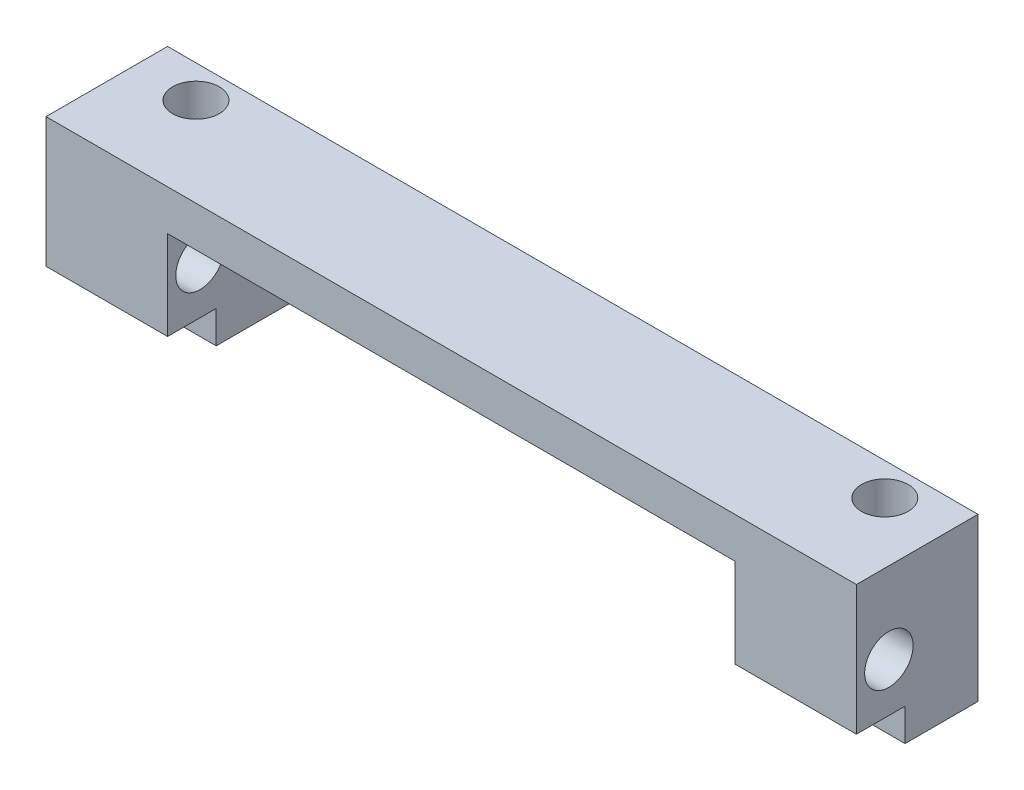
ISO-10303-21;
HEADER;
FILE_DESCRIPTION(('STEP AP214'),'2;1');
FILE_NAME('part.step','',(''),(''),'','','');
FILE_SCHEMA(('AUTOMOTIVE_DESIGN { 1 0 10303 214 1 1 1 1 }'));
ENDSEC;
DATA;
#1=APPLICATION_CONTEXT('core data for automotive mechanical design processes');
#2=APPLICATION_PROTOCOL_DEFINITION('international standard','automotive_design',2000,#1);
#3=PRODUCT_CONTEXT('',#1,'mechanical');
#4=PRODUCT('Part','Part','',(#3));
#5=PRODUCT_RELATED_PRODUCT_CATEGORY('part','',(#4));
#6=PRODUCT_DEFINITION_FORMATION('','',#4);
#7=PRODUCT_DEFINITION_CONTEXT('part definition',#1,'design');
#8=PRODUCT_DEFINITION('design','',#6,#7);
#9=PRODUCT_DEFINITION_SHAPE('','',#8);
#10=(LENGTH_UNIT() NAMED_UNIT(*) SI_UNIT(.MILLI.,.METRE.));
#11=(NAMED_UNIT(*) PLANE_ANGLE_UNIT() SI_UNIT($,.RADIAN.));
#12=(NAMED_UNIT(*) SI_UNIT($,.STERADIAN.) SOLID_ANGLE_UNIT());
#13=UNCERTAINTY_MEASURE_WITH_UNIT(LENGTH_MEASURE(1.E-05),#10,'distance_accuracy_value','');
#14=(GEOMETRIC_REPRESENTATION_CONTEXT(3) GLOBAL_UNCERTAINTY_ASSIGNED_CONTEXT((#13)) GLOBAL_UNIT_ASSIGNED_CONTEXT((#10,
#11,#12)) REPRESENTATION_CONTEXT('',''));
#15=CARTESIAN_POINT('',(0.,0.,0.));
#16=DIRECTION('',(0.,0.,1.));
#17=DIRECTION('',(1.,0.,0.));
#18=AXIS2_PLACEMENT_3D('',#15,#16,#17);
#19=CARTESIAN_POINT('',(-31.75,0.,0.));
#20=DIRECTION('',(0.,1.,0.));
#21=DIRECTION('',(0.,0.,1.));
#22=AXIS2_PLACEMENT_3D('',#19,#20,#21);
#23=PLANE('',#22);
#24=CARTESIAN_POINT('',(-26.9875,0.,-6.985));
#25=DIRECTION('',(0.,1.,0.));
#26=DIRECTION('',(0.,0.,1.));
#27=AXIS2_PLACEMENT_3D('',#24,#25,#26);
#28=CIRCLE('',#27,1.8288);
#29=CARTESIAN_POINT('',(-26.9875,0.,-5.1562));
#30=VERTEX_POINT('',#29);
#31=EDGE_CURVE('E200',#30,#30,#28,.T.);
#32=ORIENTED_EDGE('',*,*,#31,.T.);
#33=EDGE_LOOP('',(#32));
#34=FACE_BOUND('',#33,.T.);
#35=DIRECTION('',(0.,0.,1.));
#36=VECTOR('',#35,1.);
#37=CARTESIAN_POINT('',(-22.225,0.,-9.525));
#38=LINE('',#37,#36);
#39=CARTESIAN_POINT('',(-22.225,0.,-9.525));
#40=VERTEX_POINT('',#39);
#41=CARTESIAN_POINT('',(-22.225,0.,-3.81000000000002));
#42=VERTEX_POINT('',#41);
#43=EDGE_CURVE('E183',#40,#42,#38,.T.);
#44=ORIENTED_EDGE('',*,*,#43,.T.);
#45=DIRECTION('',(-1.,0.,0.));
#46=VECTOR('',#45,1.);
#47=CARTESIAN_POINT('',(31.75,0.,-3.80999999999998));
#48=LINE('',#47,#46);
#49=CARTESIAN_POINT('',(-31.75,0.,-3.81000000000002));
#50=VERTEX_POINT('',#49);
#51=EDGE_CURVE('E252',#42,#50,#48,.T.);
#52=ORIENTED_EDGE('',*,*,#51,.T.);
#53=DIRECTION('',(0.,0.,1.));
#54=VECTOR('',#53,1.);
#55=CARTESIAN_POINT('',(-31.75,0.,-9.525));
#56=LINE('',#55,#54);
#57=CARTESIAN_POINT('',(-31.75,0.,-9.525));
#58=VERTEX_POINT('',#57);
#59=EDGE_CURVE('E206',#58,#50,#56,.T.);
#60=ORIENTED_EDGE('',*,*,#59,.F.);
#61=DIRECTION('',(-1.,0.,0.));
#62=VECTOR('',#61,1.);
#63=CARTESIAN_POINT('',(-31.75,0.,-9.525));
#64=LINE('',#63,#62);
#65=EDGE_CURVE('E210',#40,#58,#64,.T.);
#66=ORIENTED_EDGE('',*,*,#65,.F.);
#67=EDGE_LOOP('',(#44,#52,#60,#66));
#68=FACE_BOUND('',#67,.T.);
#69=ADVANCED_FACE('F29',(#34,#68),#23,.F.);
#70=CARTESIAN_POINT('',(-31.75,12.7,0.));
#71=DIRECTION('',(0.,1.,0.));
#72=DIRECTION('',(0.,0.,1.));
#73=AXIS2_PLACEMENT_3D('',#70,#71,#72);
#74=PLANE('',#73);
#75=CARTESIAN_POINT('',(-26.9875,12.7,-6.985));
#76=DIRECTION('',(0.,1.,0.));
#77=DIRECTION('',(0.,0.,1.));
#78=AXIS2_PLACEMENT_3D('',#75,#76,#77);
#79=CIRCLE('',#78,1.8288);
#80=CARTESIAN_POINT('',(-26.9875,12.7,-5.1562));
#81=VERTEX_POINT('',#80);
#82=EDGE_CURVE('E203',#81,#81,#79,.T.);
#83=ORIENTED_EDGE('',*,*,#82,.F.);
#84=EDGE_LOOP('',(#83));
#85=FACE_BOUND('',#84,.T.);
#86=DIRECTION('',(0.,0.,1.));
#87=VECTOR('',#86,1.);
#88=CARTESIAN_POINT('',(-31.75,12.7,-9.525));
#89=LINE('',#88,#87);
#90=CARTESIAN_POINT('',(-31.75,12.7,-9.525));
#91=VERTEX_POINT('',#90);
#92=CARTESIAN_POINT('',(-31.75,12.7,0.));
#93=VERTEX_POINT('',#92);
#94=EDGE_CURVE('E214',#91,#93,#89,.T.);
#95=ORIENTED_EDGE('',*,*,#94,.T.);
#96=DIRECTION('',(1.,0.,0.));
#97=VECTOR('',#96,1.);
#98=CARTESIAN_POINT('',(-31.75,12.7,0.));
#99=LINE('',#98,#97);
#100=CARTESIAN_POINT('',(31.75,12.7,0.));
#101=VERTEX_POINT('',#100);
#102=EDGE_CURVE('E138',#93,#101,#99,.T.);
#103=ORIENTED_EDGE('',*,*,#102,.T.);
#104=DIRECTION('',(0.,0.,-1.));
#105=VECTOR('',#104,1.);
#106=CARTESIAN_POINT('',(31.75,12.7,-9.52500000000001));
#107=LINE('',#106,#105);
#108=CARTESIAN_POINT('',(31.75,12.7,-9.52500000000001));
#109=VERTEX_POINT('',#108);
#110=EDGE_CURVE('E217',#101,#109,#107,.T.);
#111=ORIENTED_EDGE('',*,*,#110,.T.);
#112=DIRECTION('',(-1.,0.,0.));
#113=VECTOR('',#112,1.);
#114=CARTESIAN_POINT('',(-31.75,12.7,-9.525));
#115=LINE('',#114,#113);
#116=EDGE_CURVE('E219',#109,#91,#115,.T.);
#117=ORIENTED_EDGE('',*,*,#116,.T.);
#118=EDGE_LOOP('',(#95,#103,#111,#117));
#119=FACE_BOUND('',#118,.T.);
#120=CARTESIAN_POINT('',(26.9875,12.7,-6.985));
#121=DIRECTION('',(0.,1.,0.));
#122=DIRECTION('',(0.,0.,1.));
#123=AXIS2_PLACEMENT_3D('',#120,#121,#122);
#124=CIRCLE('',#123,1.8288);
#125=CARTESIAN_POINT('',(26.9875,12.7,-5.1562));
#126=VERTEX_POINT('',#125);
#127=EDGE_CURVE('E197',#126,#126,#124,.T.);
#128=ORIENTED_EDGE('',*,*,#127,.F.);
#129=EDGE_LOOP('',(#128));
#130=FACE_BOUND('',#129,.T.);
#131=ADVANCED_FACE('F254',(#85,#119,#130),#74,.T.);
#132=DIRECTION('',(0.,0.,-1.));
#133=VECTOR('',#132,1.);
#134=CARTESIAN_POINT('',(31.75,0.,-9.52500000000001));
#135=LINE('',#134,#133);
#136=CARTESIAN_POINT('',(31.75,0.,-3.80999999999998));
#137=VERTEX_POINT('',#136);
#138=CARTESIAN_POINT('',(31.75,0.,-9.52500000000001));
#139=VERTEX_POINT('',#138);
#140=EDGE_CURVE('E208',#137,#139,#135,.T.);
#141=ORIENTED_EDGE('',*,*,#140,.F.);
#142=CARTESIAN_POINT('',(22.225,0.,-3.80999999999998));
#143=VERTEX_POINT('',#142);
#144=EDGE_CURVE('E238',#137,#143,#48,.T.);
#145=ORIENTED_EDGE('',*,*,#144,.T.);
#146=DIRECTION('',(0.,0.,1.));
#147=VECTOR('',#146,1.);
#148=CARTESIAN_POINT('',(22.225,0.,-9.525));
#149=LINE('',#148,#147);
#150=CARTESIAN_POINT('',(22.225,0.,-9.525));
#151=VERTEX_POINT('',#150);
#152=EDGE_CURVE('E190',#151,#143,#149,.T.);
#153=ORIENTED_EDGE('',*,*,#152,.F.);
#154=EDGE_CURVE('E211',#139,#151,#64,.T.);
#155=ORIENTED_EDGE('',*,*,#154,.F.);
#156=EDGE_LOOP('',(#141,#145,#153,#155));
#157=FACE_BOUND('',#156,.T.);
#158=CARTESIAN_POINT('',(26.9875,0.,-6.985));
#159=DIRECTION('',(0.,1.,0.));
#160=DIRECTION('',(0.,0.,1.));
#161=AXIS2_PLACEMENT_3D('',#158,#159,#160);
#162=CIRCLE('',#161,1.8288);
#163=CARTESIAN_POINT('',(26.9875,0.,-5.1562));
#164=VERTEX_POINT('',#163);
#165=EDGE_CURVE('E186',#164,#164,#162,.T.);
#166=ORIENTED_EDGE('',*,*,#165,.T.);
#167=EDGE_LOOP('',(#166));
#168=FACE_BOUND('',#167,.T.);
#169=ADVANCED_FACE('F235',(#157,#168),#23,.F.);
#170=CARTESIAN_POINT('',(-31.75,12.7,-9.525));
#171=DIRECTION('',(1.,0.,0.));
#172=DIRECTION('',(0.,0.,-1.));
#173=AXIS2_PLACEMENT_3D('',#170,#171,#172);
#174=PLANE('',#173);
#175=CARTESIAN_POINT('',(-31.75,6.35,-2.54));
#176=DIRECTION('',(-1.,0.,0.));
#177=DIRECTION('',(0.,0.,1.));
#178=AXIS2_PLACEMENT_3D('',#175,#176,#177);
#179=CIRCLE('',#178,1.89864999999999);
#180=CARTESIAN_POINT('',(-31.75,6.35,-0.641350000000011));
#181=VERTEX_POINT('',#180);
#182=EDGE_CURVE('E150',#181,#181,#179,.T.);
#183=ORIENTED_EDGE('',*,*,#182,.F.);
#184=EDGE_LOOP('',(#183));
#185=FACE_BOUND('',#184,.T.);
#186=ORIENTED_EDGE('',*,*,#59,.T.);
#187=DIRECTION('',(0.,-1.,0.));
#188=VECTOR('',#187,1.);
#189=CARTESIAN_POINT('',(-31.75,0.,-3.81000000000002));
#190=LINE('',#189,#188);
#191=CARTESIAN_POINT('',(-31.75,2.54,-3.81000000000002));
#192=VERTEX_POINT('',#191);
#193=EDGE_CURVE('E134',#192,#50,#190,.T.);
#194=ORIENTED_EDGE('',*,*,#193,.F.);
#195=DIRECTION('',(0.,0.,-1.));
#196=VECTOR('',#195,1.);
#197=CARTESIAN_POINT('',(-31.75,2.54,0.));
#198=LINE('',#197,#196);
#199=CARTESIAN_POINT('',(-31.75,2.54,0.));
#200=VERTEX_POINT('',#199);
#201=EDGE_CURVE('E119',#200,#192,#198,.T.);
#202=ORIENTED_EDGE('',*,*,#201,.F.);
#203=DIRECTION('',(0.,-1.,0.));
#204=VECTOR('',#203,1.);
#205=CARTESIAN_POINT('',(-31.75,12.7,0.));
#206=LINE('',#205,#204);
#207=EDGE_CURVE('E133',#93,#200,#206,.T.);
#208=ORIENTED_EDGE('',*,*,#207,.F.);
#209=ORIENTED_EDGE('',*,*,#94,.F.);
#210=DIRECTION('',(0.,-1.,0.));
#211=VECTOR('',#210,1.);
#212=CARTESIAN_POINT('',(-31.75,12.7,-9.525));
#213=LINE('',#212,#211);
#214=EDGE_CURVE('E221',#91,#58,#213,.T.);
#215=ORIENTED_EDGE('',*,*,#214,.T.);
#216=EDGE_LOOP('',(#186,#194,#202,#208,#209,#215));
#217=FACE_BOUND('',#216,.T.);
#218=ADVANCED_FACE('F31',(#185,#217),#174,.F.);
#219=CARTESIAN_POINT('',(-31.75,12.7,0.));
#220=DIRECTION('',(0.,0.,-1.));
#221=DIRECTION('',(-1.,0.,0.));
#222=AXIS2_PLACEMENT_3D('',#219,#220,#221);
#223=PLANE('',#222);
#224=ORIENTED_EDGE('',*,*,#207,.T.);
#225=DIRECTION('',(-1.,0.,0.));
#226=VECTOR('',#225,1.);
#227=CARTESIAN_POINT('',(31.75,2.54,0.));
#228=LINE('',#227,#226);
#229=CARTESIAN_POINT('',(-22.225,2.54,0.));
#230=VERTEX_POINT('',#229);
#231=EDGE_CURVE('E116',#230,#200,#228,.T.);
#232=ORIENTED_EDGE('',*,*,#231,.F.);
#233=DIRECTION('',(0.,-1.,0.));
#234=VECTOR('',#233,1.);
#235=CARTESIAN_POINT('',(-22.225,0.,0.));
#236=LINE('',#235,#234);
#237=CARTESIAN_POINT('',(-22.225,9.525,0.));
#238=VERTEX_POINT('',#237);
#239=EDGE_CURVE('E167',#238,#230,#236,.T.);
#240=ORIENTED_EDGE('',*,*,#239,.F.);
#241=DIRECTION('',(-1.,0.,0.));
#242=VECTOR('',#241,1.);
#243=CARTESIAN_POINT('',(-22.225,9.525,0.));
#244=LINE('',#243,#242);
#245=CARTESIAN_POINT('',(22.225,9.525,0.));
#246=VERTEX_POINT('',#245);
#247=EDGE_CURVE('E171',#246,#238,#244,.T.);
#248=ORIENTED_EDGE('',*,*,#247,.F.);
#249=DIRECTION('',(0.,1.,0.));
#250=VECTOR('',#249,1.);
#251=CARTESIAN_POINT('',(22.225,0.,0.));
#252=LINE('',#251,#250);
#253=CARTESIAN_POINT('',(22.225,2.54,0.));
#254=VERTEX_POINT('',#253);
#255=EDGE_CURVE('E169',#254,#246,#252,.T.);
#256=ORIENTED_EDGE('',*,*,#255,.F.);
#257=CARTESIAN_POINT('',(31.75,2.54,0.));
#258=VERTEX_POINT('',#257);
#259=EDGE_CURVE('E52',#258,#254,#228,.T.);
#260=ORIENTED_EDGE('',*,*,#259,.F.);
#261=DIRECTION('',(0.,-1.,0.));
#262=VECTOR('',#261,1.);
#263=CARTESIAN_POINT('',(31.75,12.7,0.));
#264=LINE('',#263,#262);
#265=EDGE_CURVE('E140',#101,#258,#264,.T.);
#266=ORIENTED_EDGE('',*,*,#265,.F.);
#267=ORIENTED_EDGE('',*,*,#102,.F.);
#268=EDGE_LOOP('',(#224,#232,#240,#248,#256,#260,#266,#267));
#269=FACE_BOUND('',#268,.T.);
#270=ADVANCED_FACE('F136',(#269),#223,.F.);
#271=CARTESIAN_POINT('',(31.75,12.7,-9.52500000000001));
#272=DIRECTION('',(-1.,0.,0.));
#273=DIRECTION('',(0.,0.,1.));
#274=AXIS2_PLACEMENT_3D('',#271,#272,#273);
#275=PLANE('',#274);
#276=CARTESIAN_POINT('',(31.75,6.35,-2.53999999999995));
#277=DIRECTION('',(-1.,0.,0.));
#278=DIRECTION('',(0.,0.,1.));
#279=AXIS2_PLACEMENT_3D('',#276,#277,#278);
#280=CIRCLE('',#279,1.89864999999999);
#281=CARTESIAN_POINT('',(31.75,6.35,-0.641349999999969));
#282=VERTEX_POINT('',#281);
#283=EDGE_CURVE('E154',#282,#282,#280,.T.);
#284=ORIENTED_EDGE('',*,*,#283,.T.);
#285=EDGE_LOOP('',(#284));
#286=FACE_BOUND('',#285,.T.);
#287=DIRECTION('',(0.,0.,-1.));
#288=VECTOR('',#287,1.);
#289=CARTESIAN_POINT('',(31.75,2.54,0.));
#290=LINE('',#289,#288);
#291=CARTESIAN_POINT('',(31.75,2.54,-3.80999999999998));
#292=VERTEX_POINT('',#291);
#293=EDGE_CURVE('E259',#258,#292,#290,.T.);
#294=ORIENTED_EDGE('',*,*,#293,.T.);
#295=DIRECTION('',(0.,-1.,0.));
#296=VECTOR('',#295,1.);
#297=CARTESIAN_POINT('',(31.75,0.,-3.80999999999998));
#298=LINE('',#297,#296);
#299=EDGE_CURVE('E127',#292,#137,#298,.T.);
#300=ORIENTED_EDGE('',*,*,#299,.T.);
#301=ORIENTED_EDGE('',*,*,#140,.T.);
#302=DIRECTION('',(0.,-1.,0.));
#303=VECTOR('',#302,1.);
#304=CARTESIAN_POINT('',(31.75,12.7,-9.52500000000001));
#305=LINE('',#304,#303);
#306=EDGE_CURVE('E143',#109,#139,#305,.T.);
#307=ORIENTED_EDGE('',*,*,#306,.F.);
#308=ORIENTED_EDGE('',*,*,#110,.F.);
#309=ORIENTED_EDGE('',*,*,#265,.T.);
#310=EDGE_LOOP('',(#294,#300,#301,#307,#308,#309));
#311=FACE_BOUND('',#310,.T.);
#312=ADVANCED_FACE('F257',(#286,#311),#275,.F.);
#313=CARTESIAN_POINT('',(-31.75,12.7,-9.525));
#314=DIRECTION('',(0.,0.,1.));
#315=DIRECTION('',(1.,0.,0.));
#316=AXIS2_PLACEMENT_3D('',#313,#314,#315);
#317=PLANE('',#316);
#318=DIRECTION('',(-1.,0.,0.));
#319=VECTOR('',#318,1.);
#320=CARTESIAN_POINT('',(-22.225,9.525,-9.525));
#321=LINE('',#320,#319);
#322=CARTESIAN_POINT('',(22.225,9.525,-9.52500000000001));
#323=VERTEX_POINT('',#322);
#324=CARTESIAN_POINT('',(-22.225,9.525,-9.525));
#325=VERTEX_POINT('',#324);
#326=EDGE_CURVE('E180',#323,#325,#321,.T.);
#327=ORIENTED_EDGE('',*,*,#326,.T.);
#328=DIRECTION('',(0.,-1.,0.));
#329=VECTOR('',#328,1.);
#330=CARTESIAN_POINT('',(-22.225,0.,-9.525));
#331=LINE('',#330,#329);
#332=EDGE_CURVE('E174',#325,#40,#331,.T.);
#333=ORIENTED_EDGE('',*,*,#332,.T.);
#334=ORIENTED_EDGE('',*,*,#65,.T.);
#335=ORIENTED_EDGE('',*,*,#214,.F.);
#336=ORIENTED_EDGE('',*,*,#116,.F.);
#337=ORIENTED_EDGE('',*,*,#306,.T.);
#338=ORIENTED_EDGE('',*,*,#154,.T.);
#339=DIRECTION('',(0.,1.,0.));
#340=VECTOR('',#339,1.);
#341=CARTESIAN_POINT('',(22.225,0.,-9.525));
#342=LINE('',#341,#340);
#343=EDGE_CURVE('E177',#151,#323,#342,.T.);
#344=ORIENTED_EDGE('',*,*,#343,.T.);
#345=EDGE_LOOP('',(#327,#333,#334,#335,#336,#337,#338,#344));
#346=FACE_BOUND('',#345,.T.);
#347=ADVANCED_FACE('F228',(#346),#317,.F.);
#348=CARTESIAN_POINT('',(-26.9875,12.7,-6.985));
#349=DIRECTION('',(0.,-1.,0.));
#350=DIRECTION('',(0.,0.,-1.));
#351=AXIS2_PLACEMENT_3D('',#348,#349,#350);
#352=CYLINDRICAL_SURFACE('',#351,1.8288);
#353=ORIENTED_EDGE('',*,*,#82,.T.);
#354=EDGE_LOOP('',(#353));
#355=FACE_BOUND('',#354,.T.);
#356=ORIENTED_EDGE('',*,*,#31,.F.);
#357=EDGE_LOOP('',(#356));
#358=FACE_BOUND('',#357,.T.);
#359=ADVANCED_FACE('F304',(#355,#358),#352,.F.);
#360=CARTESIAN_POINT('',(26.9875,12.7,-6.985));
#361=DIRECTION('',(0.,-1.,0.));
#362=DIRECTION('',(0.,0.,-1.));
#363=AXIS2_PLACEMENT_3D('',#360,#361,#362);
#364=CYLINDRICAL_SURFACE('',#363,1.8288);
#365=ORIENTED_EDGE('',*,*,#127,.T.);
#366=EDGE_LOOP('',(#365));
#367=FACE_BOUND('',#366,.T.);
#368=ORIENTED_EDGE('',*,*,#165,.F.);
#369=EDGE_LOOP('',(#368));
#370=FACE_BOUND('',#369,.T.);
#371=ADVANCED_FACE('F310',(#367,#370),#364,.F.);
#372=CARTESIAN_POINT('',(-22.225,0.,-9.525));
#373=DIRECTION('',(-1.,0.,0.));
#374=DIRECTION('',(0.,0.,1.));
#375=AXIS2_PLACEMENT_3D('',#372,#373,#374);
#376=PLANE('',#375);
#377=CARTESIAN_POINT('',(-22.225,6.35,-2.53999999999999));
#378=DIRECTION('',(-1.,0.,0.));
#379=DIRECTION('',(0.,0.,1.));
#380=AXIS2_PLACEMENT_3D('',#377,#378,#379);
#381=CIRCLE('',#380,1.89864999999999);
#382=CARTESIAN_POINT('',(-22.225,6.35,-0.641350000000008));
#383=VERTEX_POINT('',#382);
#384=EDGE_CURVE('E149',#383,#383,#381,.T.);
#385=ORIENTED_EDGE('',*,*,#384,.T.);
#386=EDGE_LOOP('',(#385));
#387=FACE_BOUND('',#386,.T.);
#388=DIRECTION('',(0.,0.,-1.));
#389=VECTOR('',#388,1.);
#390=CARTESIAN_POINT('',(-22.225,2.54,-9.525));
#391=LINE('',#390,#389);
#392=CARTESIAN_POINT('',(-22.225,2.54,-3.81000000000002));
#393=VERTEX_POINT('',#392);
#394=EDGE_CURVE('E122',#230,#393,#391,.T.);
#395=ORIENTED_EDGE('',*,*,#394,.T.);
#396=DIRECTION('',(0.,-1.,0.));
#397=VECTOR('',#396,1.);
#398=CARTESIAN_POINT('',(-22.225,0.,-3.81000000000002));
#399=LINE('',#398,#397);
#400=EDGE_CURVE('E157',#393,#42,#399,.T.);
#401=ORIENTED_EDGE('',*,*,#400,.T.);
#402=ORIENTED_EDGE('',*,*,#43,.F.);
#403=ORIENTED_EDGE('',*,*,#332,.F.);
#404=DIRECTION('',(0.,0.,1.));
#405=VECTOR('',#404,1.);
#406=CARTESIAN_POINT('',(-22.225,9.525,-9.525));
#407=LINE('',#406,#405);
#408=EDGE_CURVE('E184',#325,#238,#407,.T.);
#409=ORIENTED_EDGE('',*,*,#408,.T.);
#410=ORIENTED_EDGE('',*,*,#239,.T.);
#411=EDGE_LOOP('',(#395,#401,#402,#403,#409,#410));
#412=FACE_BOUND('',#411,.T.);
#413=ADVANCED_FACE('F248',(#387,#412),#376,.F.);
#414=CARTESIAN_POINT('',(-22.225,9.525,-9.525));
#415=DIRECTION('',(0.,1.,0.));
#416=DIRECTION('',(0.,0.,1.));
#417=AXIS2_PLACEMENT_3D('',#414,#415,#416);
#418=PLANE('',#417);
#419=ORIENTED_EDGE('',*,*,#247,.T.);
#420=ORIENTED_EDGE('',*,*,#408,.F.);
#421=ORIENTED_EDGE('',*,*,#326,.F.);
#422=DIRECTION('',(0.,0.,1.));
#423=VECTOR('',#422,1.);
#424=CARTESIAN_POINT('',(22.225,9.525,-9.525));
#425=LINE('',#424,#423);
#426=EDGE_CURVE('E187',#323,#246,#425,.T.);
#427=ORIENTED_EDGE('',*,*,#426,.T.);
#428=EDGE_LOOP('',(#419,#420,#421,#427));
#429=FACE_BOUND('',#428,.T.);
#430=ADVANCED_FACE('F245',(#429),#418,.F.);
#431=CARTESIAN_POINT('',(22.225,0.,-9.525));
#432=DIRECTION('',(1.,0.,0.));
#433=DIRECTION('',(0.,0.,-1.));
#434=AXIS2_PLACEMENT_3D('',#431,#432,#433);
#435=PLANE('',#434);
#436=CARTESIAN_POINT('',(22.225,6.35,-2.53999999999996));
#437=DIRECTION('',(1.,0.,0.));
#438=DIRECTION('',(0.,0.,-1.));
#439=AXIS2_PLACEMENT_3D('',#436,#437,#438);
#440=CIRCLE('',#439,1.89864999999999);
#441=CARTESIAN_POINT('',(22.225,6.35,-4.43864999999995));
#442=VERTEX_POINT('',#441);
#443=EDGE_CURVE('E147',#442,#442,#440,.T.);
#444=ORIENTED_EDGE('',*,*,#443,.T.);
#445=EDGE_LOOP('',(#444));
#446=FACE_BOUND('',#445,.T.);
#447=ORIENTED_EDGE('',*,*,#152,.T.);
#448=DIRECTION('',(0.,1.,0.));
#449=VECTOR('',#448,1.);
#450=CARTESIAN_POINT('',(22.225,0.,-3.80999999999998));
#451=LINE('',#450,#449);
#452=CARTESIAN_POINT('',(22.225,2.54,-3.80999999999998));
#453=VERTEX_POINT('',#452);
#454=EDGE_CURVE('E11',#143,#453,#451,.T.);
#455=ORIENTED_EDGE('',*,*,#454,.T.);
#456=DIRECTION('',(0.,0.,1.));
#457=VECTOR('',#456,1.);
#458=CARTESIAN_POINT('',(22.225,2.54,-9.525));
#459=LINE('',#458,#457);
#460=EDGE_CURVE('E37',#453,#254,#459,.T.);
#461=ORIENTED_EDGE('',*,*,#460,.T.);
#462=ORIENTED_EDGE('',*,*,#255,.T.);
#463=ORIENTED_EDGE('',*,*,#426,.F.);
#464=ORIENTED_EDGE('',*,*,#343,.F.);
#465=EDGE_LOOP('',(#447,#455,#461,#462,#463,#464));
#466=FACE_BOUND('',#465,.T.);
#467=ADVANCED_FACE('F240',(#446,#466),#435,.F.);
#468=CARTESIAN_POINT('',(-31.75,6.35,-2.54));
#469=DIRECTION('',(-1.,0.,0.));
#470=DIRECTION('',(0.,0.,1.));
#471=AXIS2_PLACEMENT_3D('',#468,#469,#470);
#472=CYLINDRICAL_SURFACE('',#471,1.89864999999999);
#473=ORIENTED_EDGE('',*,*,#443,.F.);
#474=EDGE_LOOP('',(#473));
#475=FACE_BOUND('',#474,.T.);
#476=ORIENTED_EDGE('',*,*,#283,.F.);
#477=EDGE_LOOP('',(#476));
#478=FACE_BOUND('',#477,.T.);
#479=ADVANCED_FACE('F323',(#475,#478),#472,.F.);
#480=ORIENTED_EDGE('',*,*,#182,.T.);
#481=EDGE_LOOP('',(#480));
#482=FACE_BOUND('',#481,.T.);
#483=ORIENTED_EDGE('',*,*,#384,.F.);
#484=EDGE_LOOP('',(#483));
#485=FACE_BOUND('',#484,.T.);
#486=ADVANCED_FACE('F326',(#482,#485),#472,.F.);
#487=CARTESIAN_POINT('',(31.75,2.54,0.));
#488=DIRECTION('',(0.,1.,0.));
#489=DIRECTION('',(0.,0.,1.));
#490=AXIS2_PLACEMENT_3D('',#487,#488,#489);
#491=PLANE('',#490);
#492=DIRECTION('',(-1.,0.,0.));
#493=VECTOR('',#492,1.);
#494=CARTESIAN_POINT('',(31.75,2.54,-3.80999999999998));
#495=LINE('',#494,#493);
#496=EDGE_CURVE('E261',#292,#453,#495,.T.);
#497=ORIENTED_EDGE('',*,*,#496,.F.);
#498=ORIENTED_EDGE('',*,*,#293,.F.);
#499=ORIENTED_EDGE('',*,*,#259,.T.);
#500=ORIENTED_EDGE('',*,*,#460,.F.);
#501=EDGE_LOOP('',(#497,#498,#499,#500));
#502=FACE_BOUND('',#501,.T.);
#503=ADVANCED_FACE('F277',(#502),#491,.F.);
#504=CARTESIAN_POINT('',(31.75,0.,-3.80999999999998));
#505=DIRECTION('',(0.,0.,-1.));
#506=DIRECTION('',(-1.,0.,0.));
#507=AXIS2_PLACEMENT_3D('',#504,#505,#506);
#508=PLANE('',#507);
#509=ORIENTED_EDGE('',*,*,#144,.F.);
#510=ORIENTED_EDGE('',*,*,#299,.F.);
#511=ORIENTED_EDGE('',*,*,#496,.T.);
#512=ORIENTED_EDGE('',*,*,#454,.F.);
#513=EDGE_LOOP('',(#509,#510,#511,#512));
#514=FACE_BOUND('',#513,.T.);
#515=ADVANCED_FACE('F270',(#514),#508,.F.);
#516=EDGE_CURVE('E44',#393,#192,#495,.T.);
#517=ORIENTED_EDGE('',*,*,#516,.T.);
#518=ORIENTED_EDGE('',*,*,#193,.T.);
#519=ORIENTED_EDGE('',*,*,#51,.F.);
#520=ORIENTED_EDGE('',*,*,#400,.F.);
#521=EDGE_LOOP('',(#517,#518,#519,#520));
#522=FACE_BOUND('',#521,.T.);
#523=ADVANCED_FACE('F268',(#522),#508,.F.);
#524=ORIENTED_EDGE('',*,*,#231,.T.);
#525=ORIENTED_EDGE('',*,*,#201,.T.);
#526=ORIENTED_EDGE('',*,*,#516,.F.);
#527=ORIENTED_EDGE('',*,*,#394,.F.);
#528=EDGE_LOOP('',(#524,#525,#526,#527));
#529=FACE_BOUND('',#528,.T.);
#530=ADVANCED_FACE('F118',(#529),#491,.F.);
#531=CLOSED_SHELL('',(#69,#131,#169,#218,#270,#312,#347,#359,#371,#413,#430,#467,#479,#486,#503,
#515,#523,#530));
#532=MANIFOLD_SOLID_BREP('B2',#531);
#533=ADVANCED_BREP_SHAPE_REPRESENTATION('',(#18,#532),#14);
#534=SHAPE_DEFINITION_REPRESENTATION(#9,#533);
ENDSEC;
END-ISO-10303-21;
